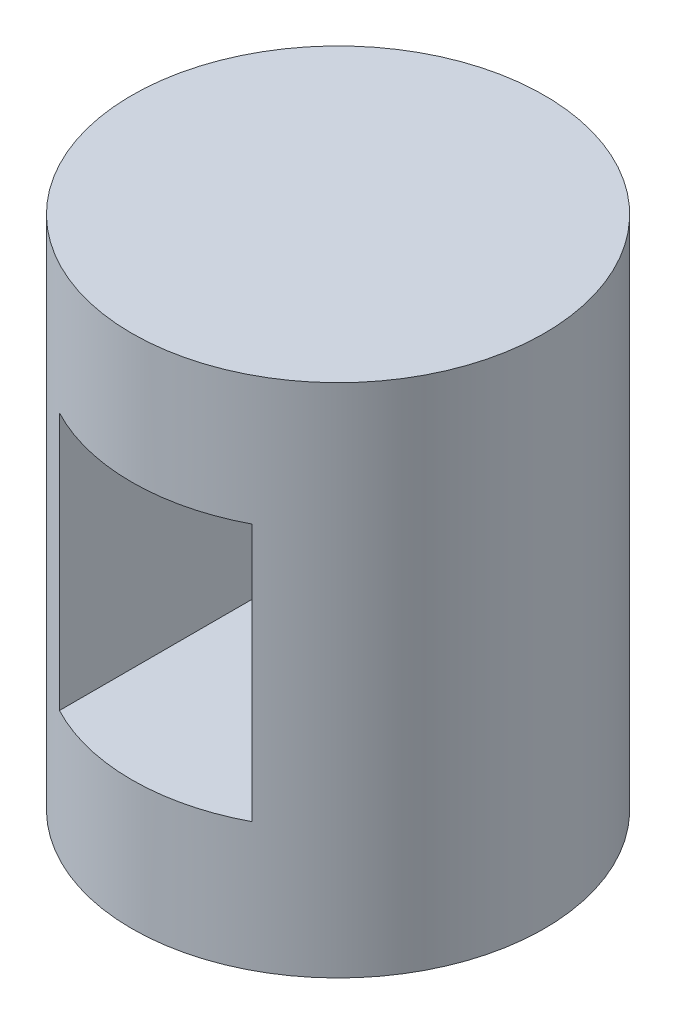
ISO-10303-21;
HEADER;
FILE_DESCRIPTION(('STEP AP214'),'2;1');
FILE_NAME('part.step','',(''),(''),'','','');
FILE_SCHEMA(('AUTOMOTIVE_DESIGN { 1 0 10303 214 1 1 1 1 }'));
ENDSEC;
DATA;
#1=APPLICATION_CONTEXT('core data for automotive mechanical design processes');
#2=APPLICATION_PROTOCOL_DEFINITION('international standard','automotive_design',2000,#1);
#3=PRODUCT_CONTEXT('',#1,'mechanical');
#4=PRODUCT('Part','Part','',(#3));
#5=PRODUCT_RELATED_PRODUCT_CATEGORY('part','',(#4));
#6=PRODUCT_DEFINITION_FORMATION('','',#4);
#7=PRODUCT_DEFINITION_CONTEXT('part definition',#1,'design');
#8=PRODUCT_DEFINITION('design','',#6,#7);
#9=PRODUCT_DEFINITION_SHAPE('','',#8);
#10=(LENGTH_UNIT() NAMED_UNIT(*) SI_UNIT(.MILLI.,.METRE.));
#11=(NAMED_UNIT(*) PLANE_ANGLE_UNIT() SI_UNIT($,.RADIAN.));
#12=(NAMED_UNIT(*) SI_UNIT($,.STERADIAN.) SOLID_ANGLE_UNIT());
#13=UNCERTAINTY_MEASURE_WITH_UNIT(LENGTH_MEASURE(1.E-05),#10,'distance_accuracy_value','');
#14=(GEOMETRIC_REPRESENTATION_CONTEXT(3) GLOBAL_UNCERTAINTY_ASSIGNED_CONTEXT((#13)) GLOBAL_UNIT_ASSIGNED_CONTEXT((#10,
#11,#12)) REPRESENTATION_CONTEXT('',''));
#15=CARTESIAN_POINT('',(0.,0.,0.));
#16=DIRECTION('',(0.,0.,1.));
#17=DIRECTION('',(1.,0.,0.));
#18=AXIS2_PLACEMENT_3D('',#15,#16,#17);
#19=CARTESIAN_POINT('',(0.,75.,0.));
#20=DIRECTION('',(0.,-1.,0.));
#21=DIRECTION('',(0.,0.,-1.));
#22=AXIS2_PLACEMENT_3D('',#19,#20,#21);
#23=CYLINDRICAL_SURFACE('',#22,30.);
#24=DIRECTION('',(0.,-1.,0.));
#25=VECTOR('',#24,1.);
#26=CARTESIAN_POINT('',(14.,75.,-26.5329983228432));
#27=LINE('',#26,#25);
#28=CARTESIAN_POINT('',(14.,18.75,-26.5329983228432));
#29=VERTEX_POINT('',#28);
#30=CARTESIAN_POINT('',(14.,56.25,-26.5329983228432));
#31=VERTEX_POINT('',#30);
#32=EDGE_CURVE('E11',#29,#31,#27,.F.);
#33=ORIENTED_EDGE('',*,*,#32,.T.);
#34=CARTESIAN_POINT('',(0.,56.25,0.));
#35=DIRECTION('',(0.,1.,0.));
#36=DIRECTION('',(0.,0.,1.));
#37=AXIS2_PLACEMENT_3D('',#34,#35,#36);
#38=CIRCLE('',#37,30.);
#39=CARTESIAN_POINT('',(-14.,56.25,-26.5329983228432));
#40=VERTEX_POINT('',#39);
#41=EDGE_CURVE('E77',#31,#40,#38,.T.);
#42=ORIENTED_EDGE('',*,*,#41,.T.);
#43=DIRECTION('',(0.,-1.,0.));
#44=VECTOR('',#43,1.);
#45=CARTESIAN_POINT('',(-14.,75.,-26.5329983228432));
#46=LINE('',#45,#44);
#47=CARTESIAN_POINT('',(-14.,18.75,-26.5329983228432));
#48=VERTEX_POINT('',#47);
#49=EDGE_CURVE('E83',#40,#48,#46,.T.);
#50=ORIENTED_EDGE('',*,*,#49,.T.);
#51=CARTESIAN_POINT('',(0.,18.75,0.));
#52=DIRECTION('',(0.,-1.,0.));
#53=DIRECTION('',(0.,0.,-1.));
#54=AXIS2_PLACEMENT_3D('',#51,#52,#53);
#55=CIRCLE('',#54,30.);
#56=EDGE_CURVE('E70',#48,#29,#55,.T.);
#57=ORIENTED_EDGE('',*,*,#56,.T.);
#58=EDGE_LOOP('',(#33,#42,#50,#57));
#59=FACE_BOUND('',#58,.T.);
#60=CARTESIAN_POINT('',(-14.,56.25,26.5329983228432));
#61=VERTEX_POINT('',#60);
#62=CARTESIAN_POINT('',(14.,56.25,26.5329983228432));
#63=VERTEX_POINT('',#62);
#64=EDGE_CURVE('E53',#61,#63,#38,.T.);
#65=ORIENTED_EDGE('',*,*,#64,.T.);
#66=DIRECTION('',(0.,-1.,0.));
#67=VECTOR('',#66,1.);
#68=CARTESIAN_POINT('',(14.,75.,26.5329983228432));
#69=LINE('',#68,#67);
#70=CARTESIAN_POINT('',(14.,18.75,26.5329983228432));
#71=VERTEX_POINT('',#70);
#72=EDGE_CURVE('E38',#63,#71,#69,.T.);
#73=ORIENTED_EDGE('',*,*,#72,.T.);
#74=CARTESIAN_POINT('',(-14.,18.75,26.5329983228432));
#75=VERTEX_POINT('',#74);
#76=EDGE_CURVE('E80',#71,#75,#55,.T.);
#77=ORIENTED_EDGE('',*,*,#76,.T.);
#78=DIRECTION('',(0.,-1.,0.));
#79=VECTOR('',#78,1.);
#80=CARTESIAN_POINT('',(-14.,75.,26.5329983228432));
#81=LINE('',#80,#79);
#82=EDGE_CURVE('E78',#75,#61,#81,.F.);
#83=ORIENTED_EDGE('',*,*,#82,.T.);
#84=EDGE_LOOP('',(#65,#73,#77,#83));
#85=FACE_BOUND('',#84,.T.);
#86=CARTESIAN_POINT('',(0.,75.,0.));
#87=DIRECTION('',(0.,1.,0.));
#88=DIRECTION('',(0.,0.,1.));
#89=AXIS2_PLACEMENT_3D('',#86,#87,#88);
#90=CIRCLE('',#89,30.);
#91=CARTESIAN_POINT('',(0.,75.,30.));
#92=VERTEX_POINT('',#91);
#93=EDGE_CURVE('E94',#92,#92,#90,.T.);
#94=ORIENTED_EDGE('',*,*,#93,.F.);
#95=EDGE_LOOP('',(#94));
#96=FACE_BOUND('',#95,.T.);
#97=CARTESIAN_POINT('',(0.,0.,0.));
#98=DIRECTION('',(0.,1.,0.));
#99=DIRECTION('',(0.,0.,1.));
#100=AXIS2_PLACEMENT_3D('',#97,#98,#99);
#101=CIRCLE('',#100,30.);
#102=CARTESIAN_POINT('',(0.,0.,30.));
#103=VERTEX_POINT('',#102);
#104=EDGE_CURVE('E95',#103,#103,#101,.T.);
#105=ORIENTED_EDGE('',*,*,#104,.T.);
#106=EDGE_LOOP('',(#105));
#107=FACE_BOUND('',#106,.T.);
#108=ADVANCED_FACE('F31',(#59,#85,#96,#107),#23,.T.);
#109=CARTESIAN_POINT('',(0.,75.,0.));
#110=DIRECTION('',(0.,1.,0.));
#111=DIRECTION('',(0.,0.,1.));
#112=AXIS2_PLACEMENT_3D('',#109,#110,#111);
#113=PLANE('',#112);
#114=ORIENTED_EDGE('',*,*,#93,.T.);
#115=EDGE_LOOP('',(#114));
#116=FACE_BOUND('',#115,.T.);
#117=ADVANCED_FACE('F120',(#116),#113,.T.);
#118=CARTESIAN_POINT('',(0.,0.,0.));
#119=DIRECTION('',(0.,1.,0.));
#120=DIRECTION('',(0.,0.,1.));
#121=AXIS2_PLACEMENT_3D('',#118,#119,#120);
#122=PLANE('',#121);
#123=ORIENTED_EDGE('',*,*,#104,.F.);
#124=EDGE_LOOP('',(#123));
#125=FACE_BOUND('',#124,.T.);
#126=ADVANCED_FACE('F117',(#125),#122,.F.);
#127=CARTESIAN_POINT('',(-14.,56.25,-30.));
#128=DIRECTION('',(-1.,0.,0.));
#129=DIRECTION('',(0.,-1.,0.));
#130=AXIS2_PLACEMENT_3D('',#127,#128,#129);
#131=PLANE('',#130);
#132=DIRECTION('',(0.,0.,1.));
#133=VECTOR('',#132,1.);
#134=CARTESIAN_POINT('',(-14.,56.25,-30.));
#135=LINE('',#134,#133);
#136=EDGE_CURVE('E98',#40,#61,#135,.T.);
#137=ORIENTED_EDGE('',*,*,#136,.T.);
#138=ORIENTED_EDGE('',*,*,#82,.F.);
#139=DIRECTION('',(0.,0.,1.));
#140=VECTOR('',#139,1.);
#141=CARTESIAN_POINT('',(-14.,18.75,-30.));
#142=LINE('',#141,#140);
#143=EDGE_CURVE('E45',#48,#75,#142,.T.);
#144=ORIENTED_EDGE('',*,*,#143,.F.);
#145=ORIENTED_EDGE('',*,*,#49,.F.);
#146=EDGE_LOOP('',(#137,#138,#144,#145));
#147=FACE_BOUND('',#146,.T.);
#148=ADVANCED_FACE('F82',(#147),#131,.F.);
#149=CARTESIAN_POINT('',(-14.,56.25,-30.));
#150=DIRECTION('',(0.,1.,0.));
#151=DIRECTION('',(0.,0.,1.));
#152=AXIS2_PLACEMENT_3D('',#149,#150,#151);
#153=PLANE('',#152);
#154=DIRECTION('',(0.,0.,1.));
#155=VECTOR('',#154,1.);
#156=CARTESIAN_POINT('',(14.,56.25,-30.));
#157=LINE('',#156,#155);
#158=EDGE_CURVE('E102',#31,#63,#157,.T.);
#159=ORIENTED_EDGE('',*,*,#158,.T.);
#160=ORIENTED_EDGE('',*,*,#64,.F.);
#161=ORIENTED_EDGE('',*,*,#136,.F.);
#162=ORIENTED_EDGE('',*,*,#41,.F.);
#163=EDGE_LOOP('',(#159,#160,#161,#162));
#164=FACE_BOUND('',#163,.T.);
#165=ADVANCED_FACE('F109',(#164),#153,.F.);
#166=CARTESIAN_POINT('',(14.,56.25,-30.));
#167=DIRECTION('',(1.,0.,0.));
#168=DIRECTION('',(0.,1.,0.));
#169=AXIS2_PLACEMENT_3D('',#166,#167,#168);
#170=PLANE('',#169);
#171=ORIENTED_EDGE('',*,*,#158,.F.);
#172=ORIENTED_EDGE('',*,*,#32,.F.);
#173=DIRECTION('',(0.,0.,1.));
#174=VECTOR('',#173,1.);
#175=CARTESIAN_POINT('',(14.,18.75,-30.));
#176=LINE('',#175,#174);
#177=EDGE_CURVE('E73',#29,#71,#176,.T.);
#178=ORIENTED_EDGE('',*,*,#177,.T.);
#179=ORIENTED_EDGE('',*,*,#72,.F.);
#180=EDGE_LOOP('',(#171,#172,#178,#179));
#181=FACE_BOUND('',#180,.T.);
#182=ADVANCED_FACE('F108',(#181),#170,.F.);
#183=CARTESIAN_POINT('',(-14.,18.75,-30.));
#184=DIRECTION('',(0.,-1.,0.));
#185=DIRECTION('',(0.,0.,-1.));
#186=AXIS2_PLACEMENT_3D('',#183,#184,#185);
#187=PLANE('',#186);
#188=ORIENTED_EDGE('',*,*,#177,.F.);
#189=ORIENTED_EDGE('',*,*,#56,.F.);
#190=ORIENTED_EDGE('',*,*,#143,.T.);
#191=ORIENTED_EDGE('',*,*,#76,.F.);
#192=EDGE_LOOP('',(#188,#189,#190,#191));
#193=FACE_BOUND('',#192,.T.);
#194=ADVANCED_FACE('F71',(#193),#187,.F.);
#195=CLOSED_SHELL('',(#108,#117,#126,#148,#165,#182,#194));
#196=MANIFOLD_SOLID_BREP('B2',#195);
#197=ADVANCED_BREP_SHAPE_REPRESENTATION('',(#18,#196),#14);
#198=SHAPE_DEFINITION_REPRESENTATION(#9,#197);
ENDSEC;
END-ISO-10303-21;
